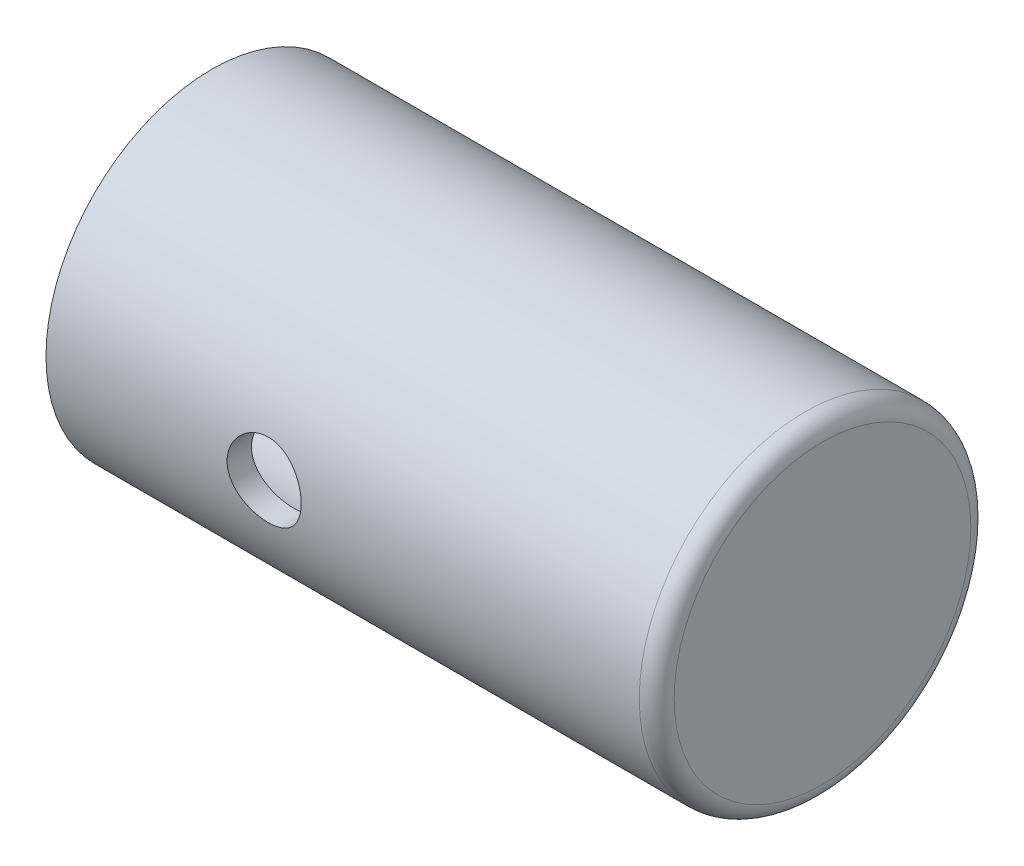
ISO-10303-21;
HEADER;
FILE_DESCRIPTION(('STEP AP214'),'2;1');
FILE_NAME('part.step','',(''),(''),'','','');
FILE_SCHEMA(('AUTOMOTIVE_DESIGN { 1 0 10303 214 1 1 1 1 }'));
ENDSEC;
DATA;
#1=APPLICATION_CONTEXT('core data for automotive mechanical design processes');
#2=APPLICATION_PROTOCOL_DEFINITION('international standard','automotive_design',2000,#1);
#3=PRODUCT_CONTEXT('',#1,'mechanical');
#4=PRODUCT('Part','Part','',(#3));
#5=PRODUCT_RELATED_PRODUCT_CATEGORY('part','',(#4));
#6=PRODUCT_DEFINITION_FORMATION('','',#4);
#7=PRODUCT_DEFINITION_CONTEXT('part definition',#1,'design');
#8=PRODUCT_DEFINITION('design','',#6,#7);
#9=PRODUCT_DEFINITION_SHAPE('','',#8);
#10=(LENGTH_UNIT() NAMED_UNIT(*) SI_UNIT(.MILLI.,.METRE.));
#11=(NAMED_UNIT(*) PLANE_ANGLE_UNIT() SI_UNIT($,.RADIAN.));
#12=(NAMED_UNIT(*) SI_UNIT($,.STERADIAN.) SOLID_ANGLE_UNIT());
#13=UNCERTAINTY_MEASURE_WITH_UNIT(LENGTH_MEASURE(1.E-05),#10,'distance_accuracy_value','');
#14=(GEOMETRIC_REPRESENTATION_CONTEXT(3) GLOBAL_UNCERTAINTY_ASSIGNED_CONTEXT((#13)) GLOBAL_UNIT_ASSIGNED_CONTEXT((#10,
#11,#12)) REPRESENTATION_CONTEXT('',''));
#15=CARTESIAN_POINT('',(0.,0.,0.));
#16=DIRECTION('',(0.,0.,1.));
#17=DIRECTION('',(1.,0.,0.));
#18=AXIS2_PLACEMENT_3D('',#15,#16,#17);
#19=CARTESIAN_POINT('',(-7.76082879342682,0.,0.));
#20=DIRECTION('',(-1.,0.,0.));
#21=DIRECTION('',(0.,0.,1.));
#22=AXIS2_PLACEMENT_3D('',#19,#20,#21);
#23=CYLINDRICAL_SURFACE('',#22,16.2);
#24=CARTESIAN_POINT('',(0.,0.,0.));
#25=DIRECTION('',(-1.,0.,0.));
#26=DIRECTION('',(0.,0.,1.));
#27=AXIS2_PLACEMENT_3D('',#24,#25,#26);
#28=CIRCLE('',#27,16.2);
#29=CARTESIAN_POINT('',(0.,0.,16.2));
#30=VERTEX_POINT('',#29);
#31=EDGE_CURVE('E49',#30,#30,#28,.T.);
#32=ORIENTED_EDGE('',*,*,#31,.T.);
#33=EDGE_LOOP('',(#32));
#34=FACE_BOUND('',#33,.T.);
#35=CARTESIAN_POINT('',(52.,0.,0.));
#36=DIRECTION('',(-1.,0.,0.));
#37=DIRECTION('',(0.,0.,1.));
#38=AXIS2_PLACEMENT_3D('',#35,#36,#37);
#39=CIRCLE('',#38,16.2);
#40=CARTESIAN_POINT('',(52.,0.,16.2));
#41=VERTEX_POINT('',#40);
#42=EDGE_CURVE('E63',#41,#41,#39,.T.);
#43=ORIENTED_EDGE('',*,*,#42,.F.);
#44=EDGE_LOOP('',(#43));
#45=FACE_BOUND('',#44,.T.);
#46=CARTESIAN_POINT('',(29.25,0.,16.2));
#47=CARTESIAN_POINT('',(29.2499941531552,-0.234429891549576,16.1999963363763));
#48=CARTESIAN_POINT('',(29.2305381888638,-0.468923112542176,16.1948611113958));
#49=CARTESIAN_POINT('',(29.1533605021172,-0.93116359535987,16.174874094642));
#50=CARTESIAN_POINT('',(29.0956195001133,-1.15890739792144,16.1600174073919));
#51=CARTESIAN_POINT('',(28.9438712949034,-1.60090923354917,16.122228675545));
#52=CARTESIAN_POINT('',(28.8499100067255,-1.81518394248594,16.0993068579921));
#53=CARTESIAN_POINT('',(28.6285563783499,-2.22493245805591,16.0478152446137));
#54=CARTESIAN_POINT('',(28.501162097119,-2.42040517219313,16.0192451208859));
#55=CARTESIAN_POINT('',(28.2135316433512,-2.79139969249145,15.958827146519));
#56=CARTESIAN_POINT('',(28.052683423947,-2.96643810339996,15.9269246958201));
#57=CARTESIAN_POINT('',(27.7040198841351,-3.28739008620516,15.8637914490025));
#58=CARTESIAN_POINT('',(27.5162012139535,-3.43330003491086,15.8325607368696));
#59=CARTESIAN_POINT('',(27.1150976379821,-3.69418800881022,15.773750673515));
#60=CARTESIAN_POINT('',(26.9014426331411,-3.80861400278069,15.7462403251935));
#61=CARTESIAN_POINT('',(26.4570891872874,-3.99973179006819,15.698786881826));
#62=CARTESIAN_POINT('',(26.2263937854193,-4.076430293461,15.6788424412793));
#63=CARTESIAN_POINT('',(25.7598517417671,-4.18824496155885,15.6493420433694));
#64=CARTESIAN_POINT('',(25.5242288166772,-4.22423564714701,15.6395679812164));
#65=CARTESIAN_POINT('',(25.0501023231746,-4.25633884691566,15.6308630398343));
#66=CARTESIAN_POINT('',(24.8115992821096,-4.25245855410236,15.6319302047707));
#67=CARTESIAN_POINT('',(24.345275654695,-4.20562514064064,15.6445917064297));
#68=CARTESIAN_POINT('',(24.1173402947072,-4.16372590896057,15.6559020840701));
#69=CARTESIAN_POINT('',(23.6718532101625,-4.04373013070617,15.6873215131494));
#70=CARTESIAN_POINT('',(23.4543022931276,-3.96563077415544,15.7074312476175));
#71=CARTESIAN_POINT('',(23.0329916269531,-3.77458256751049,15.7544361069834));
#72=CARTESIAN_POINT('',(22.8294093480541,-3.66126081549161,15.7814032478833));
#73=CARTESIAN_POINT('',(22.4437779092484,-3.40324492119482,15.8390451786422));
#74=CARTESIAN_POINT('',(22.2617328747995,-3.25854478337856,15.8697206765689));
#75=CARTESIAN_POINT('',(21.9183173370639,-2.93647233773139,15.9325085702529));
#76=CARTESIAN_POINT('',(21.7577795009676,-2.75821385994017,15.9646357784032));
#77=CARTESIAN_POINT('',(21.46870899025,-2.37691436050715,16.0258387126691));
#78=CARTESIAN_POINT('',(21.3401774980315,-2.17387242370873,16.0549143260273));
#79=CARTESIAN_POINT('',(21.1184178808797,-1.74750707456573,16.1069074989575));
#80=CARTESIAN_POINT('',(21.0253363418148,-1.52410408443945,16.1297993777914));
#81=CARTESIAN_POINT('',(20.8782890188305,-1.06408402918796,16.1666599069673));
#82=CARTESIAN_POINT('',(20.8243149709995,-0.827469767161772,16.1806304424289));
#83=CARTESIAN_POINT('',(20.7583126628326,-0.354853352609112,16.1977907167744));
#84=CARTESIAN_POINT('',(20.7451518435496,-0.119019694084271,16.2012714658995));
#85=CARTESIAN_POINT('',(20.7580275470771,0.351483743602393,16.1978945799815));
#86=CARTESIAN_POINT('',(20.7840601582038,0.586153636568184,16.1910379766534));
#87=CARTESIAN_POINT('',(20.8736535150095,1.04365412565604,16.1679443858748));
#88=CARTESIAN_POINT('',(20.9365862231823,1.2666163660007,16.1518644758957));
#89=CARTESIAN_POINT('',(21.0974672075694,1.69880017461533,16.1121449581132));
#90=CARTESIAN_POINT('',(21.1954192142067,1.90802027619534,16.0885045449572));
#91=CARTESIAN_POINT('',(21.4256838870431,2.31120951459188,16.0356003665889));
#92=CARTESIAN_POINT('',(21.5586175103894,2.50481072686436,16.0062377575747));
#93=CARTESIAN_POINT('',(21.8542878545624,2.86735683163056,15.9452851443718));
#94=CARTESIAN_POINT('',(22.0170302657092,3.0362970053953,15.9136947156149));
#95=CARTESIAN_POINT('',(22.3729772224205,3.34947028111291,15.8507822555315));
#96=CARTESIAN_POINT('',(22.5668905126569,3.4929054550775,15.819490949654));
#97=CARTESIAN_POINT('',(22.9766919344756,3.74521188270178,15.7616688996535));
#98=CARTESIAN_POINT('',(23.1925791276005,3.85408461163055,15.7351379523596));
#99=CARTESIAN_POINT('',(23.6390963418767,4.03335615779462,15.690142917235));
#100=CARTESIAN_POINT('',(23.8696310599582,4.10397991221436,15.6716317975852));
#101=CARTESIAN_POINT('',(24.3398695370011,4.20529875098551,15.6447519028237));
#102=CARTESIAN_POINT('',(24.5795710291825,4.23600364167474,15.6363806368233));
#103=CARTESIAN_POINT('',(25.0531830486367,4.25606252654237,15.6309315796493));
#104=CARTESIAN_POINT('',(25.2870361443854,4.24669703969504,15.6335040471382));
#105=CARTESIAN_POINT('',(25.7497030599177,4.18984086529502,15.6488364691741));
#106=CARTESIAN_POINT('',(25.9785170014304,4.14235109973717,15.6615961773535));
#107=CARTESIAN_POINT('',(26.4230569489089,4.01132568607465,15.6956606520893));
#108=CARTESIAN_POINT('',(26.6388656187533,3.92805312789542,15.7169029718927));
#109=CARTESIAN_POINT('',(27.0536099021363,3.72803102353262,15.7655425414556));
#110=CARTESIAN_POINT('',(27.2525429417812,3.61127638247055,15.7929407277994));
#111=CARTESIAN_POINT('',(27.634021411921,3.34368815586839,15.8517820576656));
#112=CARTESIAN_POINT('',(27.8159368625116,3.19197682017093,15.8833183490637));
#113=CARTESIAN_POINT('',(28.1521435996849,2.86046199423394,15.9463530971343));
#114=CARTESIAN_POINT('',(28.306428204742,2.68065172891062,15.9778515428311));
#115=CARTESIAN_POINT('',(28.5860967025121,2.29359431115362,16.0380334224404));
#116=CARTESIAN_POINT('',(28.7108232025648,2.08586021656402,16.0666459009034));
#117=CARTESIAN_POINT('',(28.9233861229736,1.65163199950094,16.1170635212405));
#118=CARTESIAN_POINT('',(29.0112469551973,1.42515041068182,16.1388731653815));
#119=CARTESIAN_POINT('',(29.1357023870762,0.999491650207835,16.1702995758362));
#120=CARTESIAN_POINT('',(29.1784663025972,0.802202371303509,16.1813573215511));
#121=CARTESIAN_POINT('',(29.2356163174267,0.403290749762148,16.1962087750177));
#122=CARTESIAN_POINT('',(29.2500050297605,0.20166880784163,16.20000315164));
#123=CARTESIAN_POINT('',(29.25,0.,16.2));
#124=B_SPLINE_CURVE_WITH_KNOTS('',3,(#46,#47,#48,#49,#50,#51,#52,#53,#54,#55,#56,#57,#58,#59,
#60,#61,#62,#63,#64,#65,#66,#67,#68,#69,#70,#71,#72,#73,#74,#75,#76,#77,#78,#79,#80,#81,#82,#83,
#84,#85,#86,#87,#88,#89,#90,#91,#92,#93,#94,#95,#96,#97,#98,#99,#100,#101,#102,#103,#104,#105,
#106,#107,#108,#109,#110,#111,#112,#113,#114,#115,#116,#117,#118,#119,#120,#121,#122,#123),
.UNSPECIFIED.,.T.,.F.,(4,2,2,2,2,2,2,2,2,2,2,2,2,2,2,2,2,2,2,2,2,2,2,2,2,2,2,2,2,2,2,2,2,2,2,2,
2,2,4),(0.,0.702550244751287,1.40545454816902,2.10747072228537,2.80952766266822,
3.52578193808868,4.24212525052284,4.97032690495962,5.69839899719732,6.41051387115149,
7.12250027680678,7.8153338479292,8.50822120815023,9.20870957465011,9.90933190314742,
10.6320409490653,11.3547766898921,12.0804693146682,12.8060085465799,13.5112253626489,
14.2163717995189,14.9098514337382,15.6034049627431,16.3102144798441,17.0171590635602,
17.7433514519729,18.4695128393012,19.1913560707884,19.913021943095,20.611800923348,
21.3105630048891,22.0042731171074,22.6980888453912,23.4117120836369,24.1255076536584,
24.8539378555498,25.5818849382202,26.1863109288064,26.790681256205),.UNSPECIFIED.);
#125=CARTESIAN_POINT('',(29.25,0.,16.2));
#126=VERTEX_POINT('',#125);
#127=EDGE_CURVE('E66',#126,#126,#124,.T.);
#128=ORIENTED_EDGE('',*,*,#127,.F.);
#129=EDGE_LOOP('',(#128));
#130=FACE_BOUND('',#129,.T.);
#131=ADVANCED_FACE('F30',(#34,#45,#130),#23,.F.);
#132=CARTESIAN_POINT('',(-7.76082879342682,0.,0.));
#133=DIRECTION('',(-1.,0.,0.));
#134=DIRECTION('',(0.,0.,1.));
#135=AXIS2_PLACEMENT_3D('',#132,#133,#134);
#136=CYLINDRICAL_SURFACE('',#135,19.);
#137=CARTESIAN_POINT('',(68.,0.,0.));
#138=DIRECTION('',(-1.,0.,0.));
#139=DIRECTION('',(0.,0.,1.));
#140=AXIS2_PLACEMENT_3D('',#137,#138,#139);
#141=CIRCLE('',#140,19.);
#142=CARTESIAN_POINT('',(68.,0.,19.));
#143=VERTEX_POINT('',#142);
#144=EDGE_CURVE('E45',#143,#143,#141,.T.);
#145=ORIENTED_EDGE('',*,*,#144,.T.);
#146=EDGE_LOOP('',(#145));
#147=FACE_BOUND('',#146,.T.);
#148=CARTESIAN_POINT('',(0.,0.,0.));
#149=DIRECTION('',(-1.,0.,0.));
#150=DIRECTION('',(0.,0.,1.));
#151=AXIS2_PLACEMENT_3D('',#148,#149,#150);
#152=CIRCLE('',#151,19.);
#153=CARTESIAN_POINT('',(0.,0.,19.));
#154=VERTEX_POINT('',#153);
#155=EDGE_CURVE('E54',#154,#154,#152,.T.);
#156=ORIENTED_EDGE('',*,*,#155,.F.);
#157=EDGE_LOOP('',(#156));
#158=FACE_BOUND('',#157,.T.);
#159=CARTESIAN_POINT('',(20.75,0.,19.));
#160=CARTESIAN_POINT('',(20.7500078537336,-0.235580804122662,18.9999956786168));
#161=CARTESIAN_POINT('',(20.7696537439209,-0.471255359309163,18.995574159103));
#162=CARTESIAN_POINT('',(20.8476312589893,-0.935901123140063,18.9783630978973));
#163=CARTESIAN_POINT('',(20.9059896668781,-1.16486757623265,18.9655677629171));
#164=CARTESIAN_POINT('',(21.0594657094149,-1.60931568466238,18.9330325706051));
#165=CARTESIAN_POINT('',(21.1545440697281,-1.82481146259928,18.9133001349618));
#166=CARTESIAN_POINT('',(21.3786343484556,-2.23678618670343,18.8690161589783));
#167=CARTESIAN_POINT('',(21.507645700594,-2.43326545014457,18.8444646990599));
#168=CARTESIAN_POINT('',(21.7982241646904,-2.80492450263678,18.7927691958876));
#169=CARTESIAN_POINT('',(21.9602506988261,-2.97974048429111,18.7655917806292));
#170=CARTESIAN_POINT('',(22.3112742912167,-3.29995489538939,18.7119405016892));
#171=CARTESIAN_POINT('',(22.5002738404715,-3.44535060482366,18.685466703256));
#172=CARTESIAN_POINT('',(22.9025886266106,-3.70421818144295,18.6358900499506));
#173=CARTESIAN_POINT('',(23.1161607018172,-3.8172997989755,18.6128299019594));
#174=CARTESIAN_POINT('',(23.5598781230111,-4.00582503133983,18.5731717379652));
#175=CARTESIAN_POINT('',(23.7900213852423,-4.08127336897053,18.5565729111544));
#176=CARTESIAN_POINT('',(24.256393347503,-4.19118213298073,18.5320571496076));
#177=CARTESIAN_POINT('',(24.4924625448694,-4.22628824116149,18.524003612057));
#178=CARTESIAN_POINT('',(24.9672666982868,-4.2565242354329,18.5170802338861));
#179=CARTESIAN_POINT('',(25.2060013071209,-4.25165926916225,18.5182092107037));
#180=CARTESIAN_POINT('',(25.6745375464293,-4.20261014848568,18.5293997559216));
#181=CARTESIAN_POINT('',(25.9044227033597,-4.15917890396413,18.5392902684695));
#182=CARTESIAN_POINT('',(26.3535588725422,-4.03542414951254,18.5666187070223));
#183=CARTESIAN_POINT('',(26.5728092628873,-3.95509848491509,18.5840570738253));
#184=CARTESIAN_POINT('',(26.9965540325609,-3.75915128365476,18.624683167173));
#185=CARTESIAN_POINT('',(27.200911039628,-3.64324270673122,18.6479173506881));
#186=CARTESIAN_POINT('',(27.5875519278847,-3.37962155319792,18.6974890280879));
#187=CARTESIAN_POINT('',(27.7698326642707,-3.23190445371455,18.7238269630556));
#188=CARTESIAN_POINT('',(28.1114785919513,-2.90488669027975,18.7773704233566));
#189=CARTESIAN_POINT('',(28.2702313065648,-2.72494650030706,18.8045820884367));
#190=CARTESIAN_POINT('',(28.555409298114,-2.34068577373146,18.856264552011));
#191=CARTESIAN_POINT('',(28.6818339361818,-2.13636475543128,18.8807352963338));
#192=CARTESIAN_POINT('',(28.8989292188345,-1.70837583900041,18.9242639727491));
#193=CARTESIAN_POINT('',(28.9895167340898,-1.48466440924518,18.943309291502));
#194=CARTESIAN_POINT('',(29.1316423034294,-1.02467333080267,18.9737478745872));
#195=CARTESIAN_POINT('',(29.1831863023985,-0.788395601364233,18.9851423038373));
#196=CARTESIAN_POINT('',(29.2448641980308,-0.315230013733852,18.9988284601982));
#197=CARTESIAN_POINT('',(29.2558343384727,-0.078456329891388,19.0013039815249));
#198=CARTESIAN_POINT('',(29.2383237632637,0.39354067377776,18.9973897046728));
#199=CARTESIAN_POINT('',(29.2098458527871,0.628764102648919,18.9910005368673));
#200=CARTESIAN_POINT('',(29.1149404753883,1.08819241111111,18.9701910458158));
#201=CARTESIAN_POINT('',(29.0489542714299,1.31249305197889,18.9558641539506));
#202=CARTESIAN_POINT('',(28.8813973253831,1.74684078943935,18.9207840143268));
#203=CARTESIAN_POINT('',(28.7798234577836,1.95688663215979,18.9000302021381));
#204=CARTESIAN_POINT('',(28.5422505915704,2.36020075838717,18.8539466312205));
#205=CARTESIAN_POINT('',(28.4057637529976,2.55317428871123,18.828553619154));
#206=CARTESIAN_POINT('',(28.1028787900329,2.91377845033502,18.7761326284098));
#207=CARTESIAN_POINT('',(27.9364765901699,3.08140562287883,18.749104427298));
#208=CARTESIAN_POINT('',(27.5746394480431,3.38988639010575,18.6958203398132));
#209=CARTESIAN_POINT('',(27.3787053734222,3.53015966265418,18.6695894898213));
#210=CARTESIAN_POINT('',(26.9655707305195,3.77581495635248,18.6214648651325));
#211=CARTESIAN_POINT('',(26.7483710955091,3.8811985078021,18.5995709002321));
#212=CARTESIAN_POINT('',(26.3000463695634,4.05335586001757,18.5628139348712));
#213=CARTESIAN_POINT('',(26.0690093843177,4.12035012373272,18.5479108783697));
#214=CARTESIAN_POINT('',(25.5985790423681,4.21446534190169,18.5267550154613));
#215=CARTESIAN_POINT('',(25.3591870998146,4.24159301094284,18.5205007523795));
#216=CARTESIAN_POINT('',(24.8847010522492,4.25490910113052,18.5174453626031));
#217=CARTESIAN_POINT('',(24.6496337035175,4.24201864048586,18.5204315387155));
#218=CARTESIAN_POINT('',(24.1851123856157,4.17773095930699,18.5350379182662));
#219=CARTESIAN_POINT('',(23.9556583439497,4.12633423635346,18.5466580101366));
#220=CARTESIAN_POINT('',(23.5096492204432,3.98694715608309,18.5771169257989));
#221=CARTESIAN_POINT('',(23.2930484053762,3.89909669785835,18.5959281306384));
#222=CARTESIAN_POINT('',(22.8775252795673,3.68941396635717,18.6386593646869));
#223=CARTESIAN_POINT('',(22.6786049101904,3.56757796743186,18.6625799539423));
#224=CARTESIAN_POINT('',(22.2995617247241,3.2903527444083,18.7134657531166));
#225=CARTESIAN_POINT('',(22.119924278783,3.13430960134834,18.7404845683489));
#226=CARTESIAN_POINT('',(21.7890826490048,2.79441736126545,18.7941687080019));
#227=CARTESIAN_POINT('',(21.6378850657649,2.61056182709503,18.8208339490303));
#228=CARTESIAN_POINT('',(21.3662250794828,2.21722605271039,18.8712404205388));
#229=CARTESIAN_POINT('',(21.2462122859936,2.00742916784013,18.894936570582));
#230=CARTESIAN_POINT('',(21.0433451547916,1.57015041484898,18.9362797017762));
#231=CARTESIAN_POINT('',(20.9604603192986,1.34268324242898,18.9539316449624));
#232=CARTESIAN_POINT('',(20.8486095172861,0.929229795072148,18.9781275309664));
#233=CARTESIAN_POINT('',(20.8117028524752,0.74544419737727,18.9862780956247));
#234=CARTESIAN_POINT('',(20.7623955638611,0.374458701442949,18.9972159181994));
#235=CARTESIAN_POINT('',(20.7499937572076,0.187258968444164,19.0000034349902));
#236=CARTESIAN_POINT('',(20.75,0.,19.));
#237=B_SPLINE_CURVE_WITH_KNOTS('',3,(#159,#160,#161,#162,#163,#164,#165,#166,#167,#168,#169,
#170,#171,#172,#173,#174,#175,#176,#177,#178,#179,#180,#181,#182,#183,#184,#185,#186,#187,#188,
#189,#190,#191,#192,#193,#194,#195,#196,#197,#198,#199,#200,#201,#202,#203,#204,#205,#206,#207,
#208,#209,#210,#211,#212,#213,#214,#215,#216,#217,#218,#219,#220,#221,#222,#223,#224,#225,#226,
#227,#228,#229,#230,#231,#232,#233,#234,#235,#236),.UNSPECIFIED.,.T.,.F.,(4,2,2,2,2,2,2,2,2,2,2,
2,2,2,2,2,2,2,2,2,2,2,2,2,2,2,2,2,2,2,2,2,2,2,2,2,2,2,4),(0.,0.706056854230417,1.41260269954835,
2.11839493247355,2.82417538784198,3.54054533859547,4.25698149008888,4.98173578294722,
5.70639909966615,6.41929507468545,7.13209924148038,7.83128634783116,8.53051429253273,
9.23553796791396,9.94066195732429,10.6617553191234,11.3828629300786,12.1056335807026,
12.8282941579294,13.5359746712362,14.2436048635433,14.9430775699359,15.6426117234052,
16.3525122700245,17.0625096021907,17.7862344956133,18.5099276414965,19.2294219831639,
19.94879512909,20.6517338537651,21.3546634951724,22.0549200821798,22.7552534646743,
23.4703685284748,24.1856493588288,24.9107328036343,25.6352195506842,26.1964786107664,
26.7577105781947),.UNSPECIFIED.);
#238=CARTESIAN_POINT('',(20.75,0.,19.));
#239=VERTEX_POINT('',#238);
#240=EDGE_CURVE('E10',#239,#239,#237,.T.);
#241=ORIENTED_EDGE('',*,*,#240,.F.);
#242=EDGE_LOOP('',(#241));
#243=FACE_BOUND('',#242,.T.);
#244=ADVANCED_FACE('F92',(#147,#158,#243),#136,.T.);
#245=CARTESIAN_POINT('',(0.,16.2,0.));
#246=DIRECTION('',(1.,0.,0.));
#247=DIRECTION('',(0.,0.,-1.));
#248=AXIS2_PLACEMENT_3D('',#245,#246,#247);
#249=PLANE('',#248);
#250=ORIENTED_EDGE('',*,*,#31,.F.);
#251=EDGE_LOOP('',(#250));
#252=FACE_BOUND('',#251,.T.);
#253=ORIENTED_EDGE('',*,*,#155,.T.);
#254=EDGE_LOOP('',(#253));
#255=FACE_BOUND('',#254,.T.);
#256=ADVANCED_FACE('F91',(#252,#255),#249,.F.);
#257=CARTESIAN_POINT('',(70.,19.,0.));
#258=DIRECTION('',(-1.,0.,0.));
#259=DIRECTION('',(0.,0.,1.));
#260=AXIS2_PLACEMENT_3D('',#257,#258,#259);
#261=PLANE('',#260);
#262=CARTESIAN_POINT('',(70.,0.,0.));
#263=DIRECTION('',(-1.,0.,0.));
#264=DIRECTION('',(0.,0.,1.));
#265=AXIS2_PLACEMENT_3D('',#262,#263,#264);
#266=CIRCLE('',#265,17.);
#267=CARTESIAN_POINT('',(70.,0.,17.));
#268=VERTEX_POINT('',#267);
#269=EDGE_CURVE('E41',#268,#268,#266,.F.);
#270=ORIENTED_EDGE('',*,*,#269,.T.);
#271=EDGE_LOOP('',(#270));
#272=FACE_BOUND('',#271,.T.);
#273=ADVANCED_FACE('F88',(#272),#261,.F.);
#274=CARTESIAN_POINT('',(66.5,0.,0.));
#275=DIRECTION('',(1.,0.,0.));
#276=DIRECTION('',(0.,0.,-1.));
#277=AXIS2_PLACEMENT_3D('',#274,#275,#276);
#278=PLANE('',#277);
#279=CARTESIAN_POINT('',(66.5,0.,0.));
#280=DIRECTION('',(-1.,0.,0.));
#281=DIRECTION('',(0.,0.,1.));
#282=AXIS2_PLACEMENT_3D('',#279,#280,#281);
#283=CIRCLE('',#282,14.25);
#284=CARTESIAN_POINT('',(66.5,0.,14.25));
#285=VERTEX_POINT('',#284);
#286=EDGE_CURVE('E57',#285,#285,#283,.T.);
#287=ORIENTED_EDGE('',*,*,#286,.T.);
#288=EDGE_LOOP('',(#287));
#289=FACE_BOUND('',#288,.T.);
#290=ADVANCED_FACE('F84',(#289),#278,.F.);
#291=CARTESIAN_POINT('',(-7.76082879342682,0.,0.));
#292=DIRECTION('',(-1.,0.,0.));
#293=DIRECTION('',(0.,0.,1.));
#294=AXIS2_PLACEMENT_3D('',#291,#292,#293);
#295=CYLINDRICAL_SURFACE('',#294,14.25);
#296=ORIENTED_EDGE('',*,*,#286,.F.);
#297=EDGE_LOOP('',(#296));
#298=FACE_BOUND('',#297,.T.);
#299=CARTESIAN_POINT('',(52.,0.,0.));
#300=DIRECTION('',(-1.,0.,0.));
#301=DIRECTION('',(0.,0.,1.));
#302=AXIS2_PLACEMENT_3D('',#299,#300,#301);
#303=CIRCLE('',#302,14.25);
#304=CARTESIAN_POINT('',(52.,0.,14.25));
#305=VERTEX_POINT('',#304);
#306=EDGE_CURVE('E60',#305,#305,#303,.T.);
#307=ORIENTED_EDGE('',*,*,#306,.T.);
#308=EDGE_LOOP('',(#307));
#309=FACE_BOUND('',#308,.T.);
#310=ADVANCED_FACE('F80',(#298,#309),#295,.F.);
#311=CARTESIAN_POINT('',(52.,16.2,0.));
#312=DIRECTION('',(1.,0.,0.));
#313=DIRECTION('',(0.,0.,-1.));
#314=AXIS2_PLACEMENT_3D('',#311,#312,#313);
#315=PLANE('',#314);
#316=ORIENTED_EDGE('',*,*,#306,.F.);
#317=EDGE_LOOP('',(#316));
#318=FACE_BOUND('',#317,.T.);
#319=ORIENTED_EDGE('',*,*,#42,.T.);
#320=EDGE_LOOP('',(#319));
#321=FACE_BOUND('',#320,.T.);
#322=ADVANCED_FACE('F76',(#318,#321),#315,.F.);
#323=CARTESIAN_POINT('',(68.,0.,0.));
#324=DIRECTION('',(-1.,0.,0.));
#325=DIRECTION('',(0.,0.,1.));
#326=AXIS2_PLACEMENT_3D('',#323,#324,#325);
#327=TOROIDAL_SURFACE('',#326,17.,2.);
#328=ORIENTED_EDGE('',*,*,#269,.F.);
#329=EDGE_LOOP('',(#328));
#330=FACE_BOUND('',#329,.T.);
#331=ORIENTED_EDGE('',*,*,#144,.F.);
#332=EDGE_LOOP('',(#331));
#333=FACE_BOUND('',#332,.T.);
#334=ADVANCED_FACE('F32',(#330,#333),#327,.T.);
#335=CARTESIAN_POINT('',(25.,0.,19.));
#336=DIRECTION('',(0.,0.,-1.));
#337=DIRECTION('',(-1.,0.,0.));
#338=AXIS2_PLACEMENT_3D('',#335,#336,#337);
#339=CYLINDRICAL_SURFACE('',#338,4.25);
#340=ORIENTED_EDGE('',*,*,#240,.T.);
#341=EDGE_LOOP('',(#340));
#342=FACE_BOUND('',#341,.T.);
#343=ORIENTED_EDGE('',*,*,#127,.T.);
#344=EDGE_LOOP('',(#343));
#345=FACE_BOUND('',#344,.T.);
#346=ADVANCED_FACE('F72',(#342,#345),#339,.F.);
#347=CLOSED_SHELL('',(#131,#244,#256,#273,#290,#310,#322,#334,#346));
#348=MANIFOLD_SOLID_BREP('B2',#347);
#349=ADVANCED_BREP_SHAPE_REPRESENTATION('',(#18,#348),#14);
#350=SHAPE_DEFINITION_REPRESENTATION(#9,#349);
ENDSEC;
END-ISO-10303-21;
